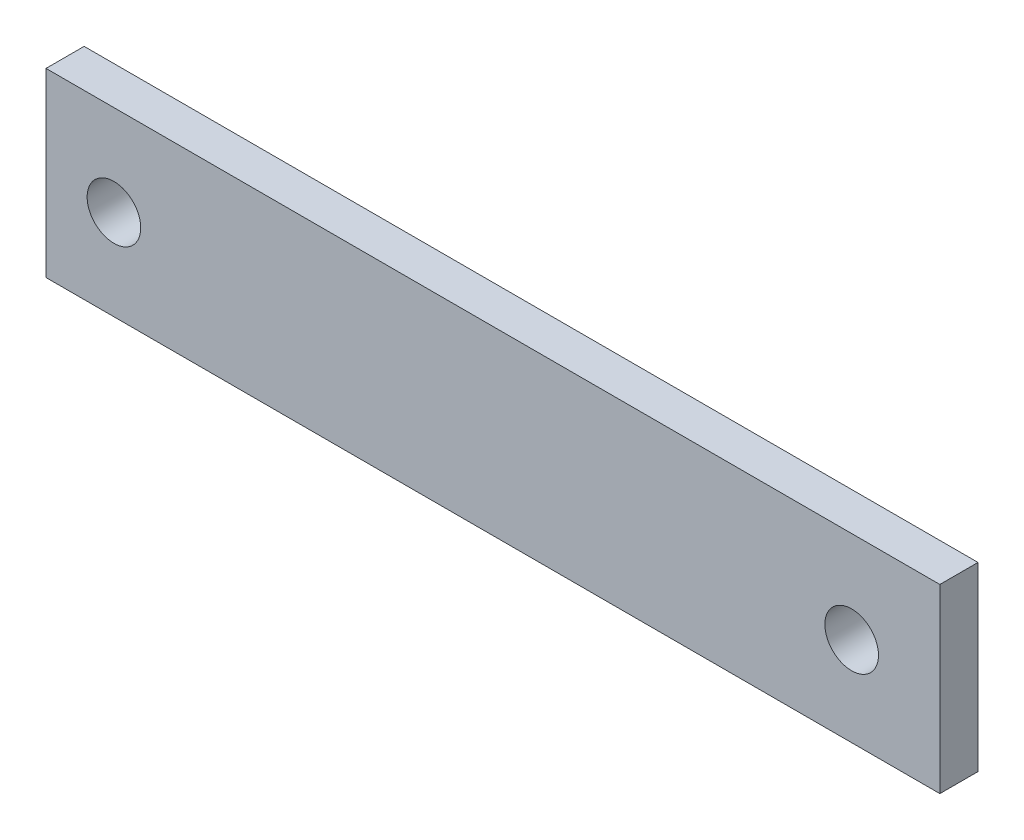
from build123d import *

# Parameters (mm, degrees)
ESQUISSE2_W      = 37.5
ESQUISSE2_H      = 7.6
ESQUISSE2_R      = 1.124917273
EXTRUSION1_DEPTH = 1.6


with BuildPart() as part:
    # Esquisse2 → Extrusion1 (new body)
    with BuildSketch(Plane.XY):
        with Locations((-5.6432594, 15.285984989)):
            Rectangle(ESQUISSE2_W, ESQUISSE2_H)
        with Locations((9.4067406, 15.22457088)):
            Circle(ESQUISSE2_R, mode=Mode.SUBTRACT)
        with Locations((-21.5432594, 15.279262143)):
            Circle(ESQUISSE2_R, mode=Mode.SUBTRACT)
    extrude(amount=EXTRUSION1_DEPTH)


solid = part.part
